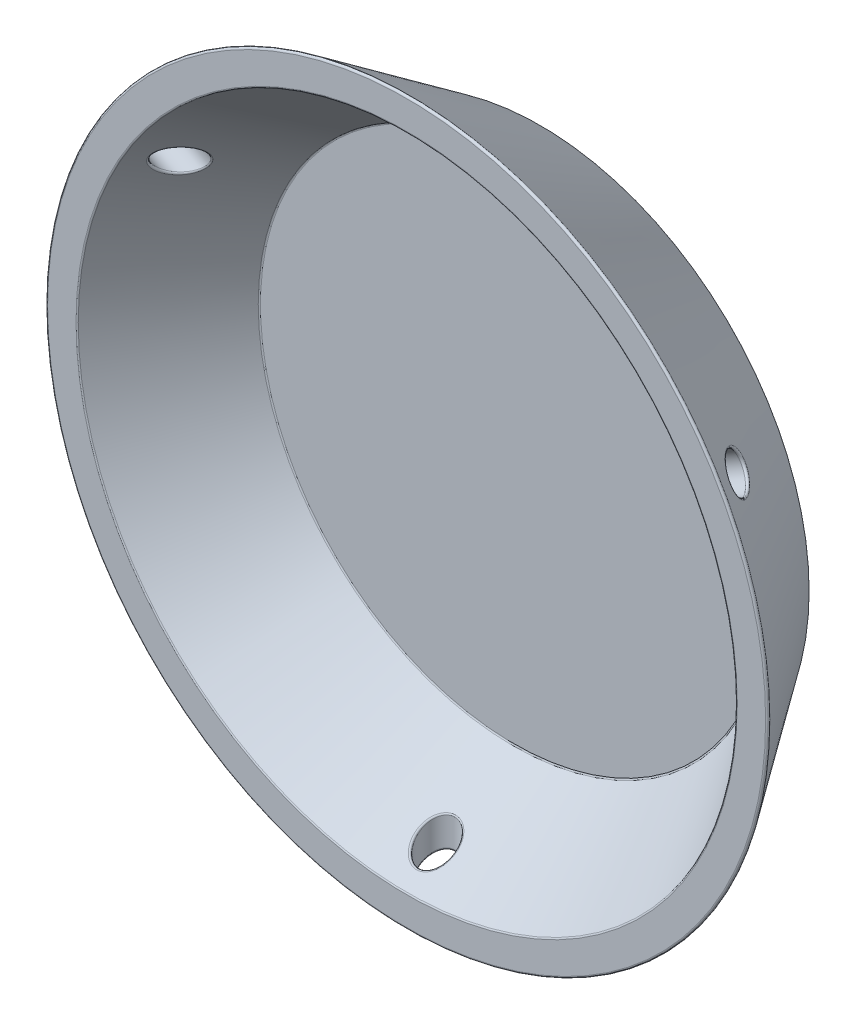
from build123d import *

# Parameters (mm, degrees)
SKIZZE1_R                       = 30
AUFSATZ_LINEAR_AUSTRAGEN1_DEPTH = 15
AUFSATZ_LINEAR_AUSTRAGEN1_DRAFT = -35
WANDUNG1_T                      = -3
SKIZZE3_R                       = 2
SCHNITT_LINEAR_AUSTRAGEN1_DEPTH = 60.211521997
KREISMUSTER1_COUNT              = 3
VERRUNDUNG1_R                   = 0.2
VERRUNDUNG2_R                   = 0.2
VERRUNDUNG3_R                   = 0.2
VERRUNDUNG4_R                   = 0.2
VERRUNDUNG5_R                   = 0.2
VERRUNDUNG6_R                   = 0.2


with BuildPart() as part:
    # Skizze1 → Aufsatz-Linear austragen1 (with draft: the straight prism first)
    with BuildSketch(Plane.XY):
        Circle(SKIZZE1_R)
    extrude(amount=AUFSATZ_LINEAR_AUSTRAGEN1_DEPTH)
    # Aufsatz-Linear austragen1: the draft: its side faces are tilted about the plane it starts from
    aufsatz_linear_austragen1_sides = [part.faces().sort_by_distance(p)[0] for p in [
        (-30, 0, 7.5),
    ]]
    draft(aufsatz_linear_austragen1_sides, Plane.XY, AUFSATZ_LINEAR_AUSTRAGEN1_DRAFT)

    # Wandung1
    wandung1_openings = [part.faces().sort_by_distance(p)[0] for p in [
        (0, 0, 15),
    ]]
    offset(amount=WANDUNG1_T, openings=wandung1_openings, kind=Kind.INTERSECTION)

    # Skizze3 → Schnitt-Linear austragen1 (cut, through all)
    with BuildSketch(Plane(origin=(0, 0, 0), x_dir=(1, 0, 0), z_dir=(0, 1, 0))):
        with Locations(Location((-0.596231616, -11, 0), (0, 0, 233.74601778))):
            Circle(SKIZZE3_R)
    schnitt_linear_austragen1 = extrude(amount=-SCHNITT_LINEAR_AUSTRAGEN1_DEPTH, mode=Mode.SUBTRACT)

    # Kreismuster1: Schnitt-Linear austragen1 ×3 about axis
    kreismuster1_axis = Axis((0, 0, 1.720729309), (0, 0, 1))
    for i in range(1, KREISMUSTER1_COUNT):
        add(schnitt_linear_austragen1.rotate(kreismuster1_axis, i * 360 / KREISMUSTER1_COUNT), mode=Mode.SUBTRACT)

    # Verrundung1
    verrundung1_edges = [part.edges().sort_by_distance(p)[0] for p in [
        (-40.503113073, 0, 15),
    ]]
    fillet(verrundung1_edges, radius=VERRUNDUNG1_R)

    # Verrundung2
    verrundung2_edges = [part.edges().sort_by_distance(p)[0] for p in [
        (-36.840789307, 0, 15),
    ]]
    fillet(verrundung2_edges, radius=VERRUNDUNG2_R)

    # Verrundung3
    verrundung3_edges = [part.edges().sort_by_distance(p)[0] for p in [
        (-28.438298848, 0, 3),
    ]]
    fillet(verrundung3_edges, radius=VERRUNDUNG3_R)

    # Verrundung4
    verrundung4_edges = [part.edges().sort_by_distance(p)[0] for p in [
        (-30, 0, 0),
    ]]
    fillet(verrundung4_edges, radius=VERRUNDUNG4_R)

    # Verrundung5
    verrundung5_edges = [part.edges().sort_by_distance(p)[0] for p in [
        (31.37537183, 18.799323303, 9.391984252),
    ]]
    fillet(verrundung5_edges, radius=VERRUNDUNG5_R)

    # Verrundung6
    verrundung6_edges = [part.edges().sort_by_distance(p)[0] for p in [
        (0.593005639, -36.57153071, 9.391984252),
        (0.593611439, -32.908974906, 9.392432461),
        (28.203202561, 16.968570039, 9.392432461),
        (-31.96837747, 17.772207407, 9.391984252),
        (-28.796814, 15.940404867, 9.392432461),
    ]]
    fillet(verrundung6_edges, radius=VERRUNDUNG6_R)


solid = part.part
